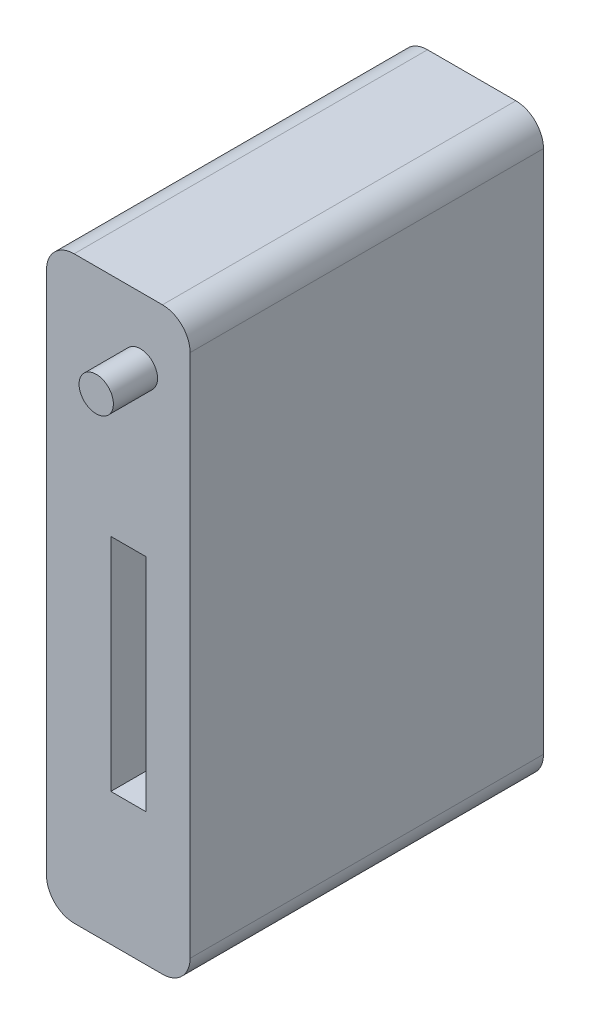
ISO-10303-21;
HEADER;
FILE_DESCRIPTION(('STEP AP214'),'2;1');
FILE_NAME('part.step','',(''),(''),'','','');
FILE_SCHEMA(('AUTOMOTIVE_DESIGN { 1 0 10303 214 1 1 1 1 }'));
ENDSEC;
DATA;
#1=APPLICATION_CONTEXT('core data for automotive mechanical design processes');
#2=APPLICATION_PROTOCOL_DEFINITION('international standard','automotive_design',2000,#1);
#3=PRODUCT_CONTEXT('',#1,'mechanical');
#4=PRODUCT('Part','Part','',(#3));
#5=PRODUCT_RELATED_PRODUCT_CATEGORY('part','',(#4));
#6=PRODUCT_DEFINITION_FORMATION('','',#4);
#7=PRODUCT_DEFINITION_CONTEXT('part definition',#1,'design');
#8=PRODUCT_DEFINITION('design','',#6,#7);
#9=PRODUCT_DEFINITION_SHAPE('','',#8);
#10=(LENGTH_UNIT() NAMED_UNIT(*) SI_UNIT(.MILLI.,.METRE.));
#11=(NAMED_UNIT(*) PLANE_ANGLE_UNIT() SI_UNIT($,.RADIAN.));
#12=(NAMED_UNIT(*) SI_UNIT($,.STERADIAN.) SOLID_ANGLE_UNIT());
#13=UNCERTAINTY_MEASURE_WITH_UNIT(LENGTH_MEASURE(1.E-05),#10,'distance_accuracy_value','');
#14=(GEOMETRIC_REPRESENTATION_CONTEXT(3) GLOBAL_UNCERTAINTY_ASSIGNED_CONTEXT((#13)) GLOBAL_UNIT_ASSIGNED_CONTEXT((#10,
#11,#12)) REPRESENTATION_CONTEXT('',''));
#15=CARTESIAN_POINT('',(0.,0.,0.));
#16=DIRECTION('',(0.,0.,1.));
#17=DIRECTION('',(1.,0.,0.));
#18=AXIS2_PLACEMENT_3D('',#15,#16,#17);
#19=CARTESIAN_POINT('',(-8.,-47.5,32.));
#20=DIRECTION('',(0.,0.,-1.));
#21=DIRECTION('',(-1.,0.,0.));
#22=AXIS2_PLACEMENT_3D('',#19,#20,#21);
#23=PLANE('',#22);
#24=CARTESIAN_POINT('',(-8.,-47.5,32.));
#25=DIRECTION('',(0.,0.,1.));
#26=DIRECTION('',(-1.,0.,0.));
#27=AXIS2_PLACEMENT_3D('',#24,#25,#26);
#28=CIRCLE('',#27,5.);
#29=CARTESIAN_POINT('',(-13.,-47.5,32.));
#30=VERTEX_POINT('',#29);
#31=CARTESIAN_POINT('',(-8.,-52.5,32.));
#32=VERTEX_POINT('',#31);
#33=EDGE_CURVE('E160',#30,#32,#28,.T.);
#34=ORIENTED_EDGE('',*,*,#33,.T.);
#35=DIRECTION('',(1.,0.,0.));
#36=VECTOR('',#35,1.);
#37=CARTESIAN_POINT('',(-8.,-52.5,32.));
#38=LINE('',#37,#36);
#39=CARTESIAN_POINT('',(7.99999999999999,-52.5,32.));
#40=VERTEX_POINT('',#39);
#41=EDGE_CURVE('E100',#32,#40,#38,.T.);
#42=ORIENTED_EDGE('',*,*,#41,.T.);
#43=CARTESIAN_POINT('',(7.99999999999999,-47.5,32.));
#44=DIRECTION('',(0.,0.,1.));
#45=DIRECTION('',(1.,0.,0.));
#46=AXIS2_PLACEMENT_3D('',#43,#44,#45);
#47=CIRCLE('',#46,5.);
#48=CARTESIAN_POINT('',(13.,-47.5,32.));
#49=VERTEX_POINT('',#48);
#50=EDGE_CURVE('E191',#40,#49,#47,.T.);
#51=ORIENTED_EDGE('',*,*,#50,.T.);
#52=DIRECTION('',(0.,1.,0.));
#53=VECTOR('',#52,1.);
#54=CARTESIAN_POINT('',(13.,-47.5,32.));
#55=LINE('',#54,#53);
#56=CARTESIAN_POINT('',(13.,47.5,32.));
#57=VERTEX_POINT('',#56);
#58=EDGE_CURVE('E190',#49,#57,#55,.T.);
#59=ORIENTED_EDGE('',*,*,#58,.T.);
#60=CARTESIAN_POINT('',(7.99999999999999,47.5,32.));
#61=DIRECTION('',(0.,0.,1.));
#62=DIRECTION('',(-1.,0.,0.));
#63=AXIS2_PLACEMENT_3D('',#60,#61,#62);
#64=CIRCLE('',#63,5.);
#65=CARTESIAN_POINT('',(7.99999999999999,52.5,32.));
#66=VERTEX_POINT('',#65);
#67=EDGE_CURVE('E123',#57,#66,#64,.T.);
#68=ORIENTED_EDGE('',*,*,#67,.T.);
#69=DIRECTION('',(-1.,0.,0.));
#70=VECTOR('',#69,1.);
#71=CARTESIAN_POINT('',(-8.,52.5,32.));
#72=LINE('',#71,#70);
#73=CARTESIAN_POINT('',(-8.,52.5,32.));
#74=VERTEX_POINT('',#73);
#75=EDGE_CURVE('E116',#66,#74,#72,.T.);
#76=ORIENTED_EDGE('',*,*,#75,.T.);
#77=CARTESIAN_POINT('',(-8.,47.5,32.));
#78=DIRECTION('',(0.,0.,1.));
#79=DIRECTION('',(-1.,0.,0.));
#80=AXIS2_PLACEMENT_3D('',#77,#78,#79);
#81=CIRCLE('',#80,5.);
#82=CARTESIAN_POINT('',(-13.,47.5,32.));
#83=VERTEX_POINT('',#82);
#84=EDGE_CURVE('E120',#74,#83,#81,.T.);
#85=ORIENTED_EDGE('',*,*,#84,.T.);
#86=DIRECTION('',(0.,-1.,0.));
#87=VECTOR('',#86,1.);
#88=CARTESIAN_POINT('',(-13.,-47.5,32.));
#89=LINE('',#88,#87);
#90=EDGE_CURVE('E58',#83,#30,#89,.T.);
#91=ORIENTED_EDGE('',*,*,#90,.T.);
#92=EDGE_LOOP('',(#34,#42,#51,#59,#68,#76,#85,#91));
#93=FACE_BOUND('',#92,.T.);
#94=DIRECTION('',(1.,0.,0.));
#95=VECTOR('',#94,1.);
#96=CARTESIAN_POINT('',(-1.35000000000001,-28.5,32.));
#97=LINE('',#96,#95);
#98=CARTESIAN_POINT('',(-1.35000000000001,-28.5,32.));
#99=VERTEX_POINT('',#98);
#100=CARTESIAN_POINT('',(4.99999999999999,-28.5,32.));
#101=VERTEX_POINT('',#100);
#102=EDGE_CURVE('E214',#99,#101,#97,.T.);
#103=ORIENTED_EDGE('',*,*,#102,.F.);
#104=DIRECTION('',(0.,-1.,0.));
#105=VECTOR('',#104,1.);
#106=CARTESIAN_POINT('',(-1.35000000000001,-28.5,32.));
#107=LINE('',#106,#105);
#108=CARTESIAN_POINT('',(-1.35000000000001,11.5,32.));
#109=VERTEX_POINT('',#108);
#110=EDGE_CURVE('E49',#109,#99,#107,.T.);
#111=ORIENTED_EDGE('',*,*,#110,.F.);
#112=DIRECTION('',(-1.,0.,0.));
#113=VECTOR('',#112,1.);
#114=CARTESIAN_POINT('',(-1.35000000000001,11.5,32.));
#115=LINE('',#114,#113);
#116=CARTESIAN_POINT('',(4.99999999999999,11.5,32.));
#117=VERTEX_POINT('',#116);
#118=EDGE_CURVE('E207',#117,#109,#115,.T.);
#119=ORIENTED_EDGE('',*,*,#118,.F.);
#120=DIRECTION('',(0.,1.,0.));
#121=VECTOR('',#120,1.);
#122=CARTESIAN_POINT('',(4.99999999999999,-28.5,32.));
#123=LINE('',#122,#121);
#124=EDGE_CURVE('E211',#101,#117,#123,.T.);
#125=ORIENTED_EDGE('',*,*,#124,.F.);
#126=EDGE_LOOP('',(#103,#111,#119,#125));
#127=FACE_BOUND('',#126,.T.);
#128=CARTESIAN_POINT('',(3.99999999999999,40.5,32.));
#129=DIRECTION('',(0.,0.,-1.));
#130=DIRECTION('',(-1.,0.,0.));
#131=AXIS2_PLACEMENT_3D('',#128,#129,#130);
#132=CIRCLE('',#131,3.105);
#133=CARTESIAN_POINT('',(0.894999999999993,40.5,32.));
#134=VERTEX_POINT('',#133);
#135=EDGE_CURVE('E11',#134,#134,#132,.F.);
#136=ORIENTED_EDGE('',*,*,#135,.F.);
#137=EDGE_LOOP('',(#136));
#138=FACE_BOUND('',#137,.T.);
#139=ADVANCED_FACE('F34',(#93,#127,#138),#23,.F.);
#140=CARTESIAN_POINT('',(-8.,-47.5,32.));
#141=DIRECTION('',(0.,0.,-1.));
#142=DIRECTION('',(-1.,0.,0.));
#143=AXIS2_PLACEMENT_3D('',#140,#141,#142);
#144=CYLINDRICAL_SURFACE('',#143,5.);
#145=CARTESIAN_POINT('',(-8.,-47.5,-32.));
#146=DIRECTION('',(0.,0.,1.));
#147=DIRECTION('',(-1.,0.,0.));
#148=AXIS2_PLACEMENT_3D('',#145,#146,#147);
#149=CIRCLE('',#148,5.);
#150=CARTESIAN_POINT('',(-13.,-47.5,-32.));
#151=VERTEX_POINT('',#150);
#152=CARTESIAN_POINT('',(-8.,-52.5,-32.));
#153=VERTEX_POINT('',#152);
#154=EDGE_CURVE('E144',#151,#153,#149,.T.);
#155=ORIENTED_EDGE('',*,*,#154,.T.);
#156=DIRECTION('',(0.,0.,-1.));
#157=VECTOR('',#156,1.);
#158=CARTESIAN_POINT('',(-8.,-52.5,32.));
#159=LINE('',#158,#157);
#160=EDGE_CURVE('E42',#32,#153,#159,.T.);
#161=ORIENTED_EDGE('',*,*,#160,.F.);
#162=ORIENTED_EDGE('',*,*,#33,.F.);
#163=DIRECTION('',(0.,0.,-1.));
#164=VECTOR('',#163,1.);
#165=CARTESIAN_POINT('',(-13.,-47.5,32.));
#166=LINE('',#165,#164);
#167=EDGE_CURVE('E140',#30,#151,#166,.T.);
#168=ORIENTED_EDGE('',*,*,#167,.T.);
#169=EDGE_LOOP('',(#155,#161,#162,#168));
#170=FACE_BOUND('',#169,.T.);
#171=ADVANCED_FACE('F36',(#170),#144,.T.);
#172=CARTESIAN_POINT('',(-8.,-52.5,32.));
#173=DIRECTION('',(0.,1.,0.));
#174=DIRECTION('',(0.,0.,1.));
#175=AXIS2_PLACEMENT_3D('',#172,#173,#174);
#176=PLANE('',#175);
#177=DIRECTION('',(1.,0.,0.));
#178=VECTOR('',#177,1.);
#179=CARTESIAN_POINT('',(-8.,-52.5,-32.));
#180=LINE('',#179,#178);
#181=CARTESIAN_POINT('',(7.99999999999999,-52.5,-32.));
#182=VERTEX_POINT('',#181);
#183=EDGE_CURVE('E147',#153,#182,#180,.T.);
#184=ORIENTED_EDGE('',*,*,#183,.T.);
#185=DIRECTION('',(0.,0.,-1.));
#186=VECTOR('',#185,1.);
#187=CARTESIAN_POINT('',(7.99999999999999,-52.5,32.));
#188=LINE('',#187,#186);
#189=EDGE_CURVE('E170',#40,#182,#188,.T.);
#190=ORIENTED_EDGE('',*,*,#189,.F.);
#191=ORIENTED_EDGE('',*,*,#41,.F.);
#192=ORIENTED_EDGE('',*,*,#160,.T.);
#193=EDGE_LOOP('',(#184,#190,#191,#192));
#194=FACE_BOUND('',#193,.T.);
#195=ADVANCED_FACE('F173',(#194),#176,.F.);
#196=CARTESIAN_POINT('',(7.99999999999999,-47.5,32.));
#197=DIRECTION('',(0.,0.,-1.));
#198=DIRECTION('',(-1.,0.,0.));
#199=AXIS2_PLACEMENT_3D('',#196,#197,#198);
#200=CYLINDRICAL_SURFACE('',#199,5.);
#201=CARTESIAN_POINT('',(7.99999999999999,-47.5,-32.));
#202=DIRECTION('',(0.,0.,1.));
#203=DIRECTION('',(1.,0.,0.));
#204=AXIS2_PLACEMENT_3D('',#201,#202,#203);
#205=CIRCLE('',#204,5.);
#206=CARTESIAN_POINT('',(13.,-47.5,-32.));
#207=VERTEX_POINT('',#206);
#208=EDGE_CURVE('E150',#182,#207,#205,.T.);
#209=ORIENTED_EDGE('',*,*,#208,.T.);
#210=DIRECTION('',(0.,0.,-1.));
#211=VECTOR('',#210,1.);
#212=CARTESIAN_POINT('',(13.,-47.5,32.));
#213=LINE('',#212,#211);
#214=EDGE_CURVE('E167',#49,#207,#213,.T.);
#215=ORIENTED_EDGE('',*,*,#214,.F.);
#216=ORIENTED_EDGE('',*,*,#50,.F.);
#217=ORIENTED_EDGE('',*,*,#189,.T.);
#218=EDGE_LOOP('',(#209,#215,#216,#217));
#219=FACE_BOUND('',#218,.T.);
#220=ADVANCED_FACE('F184',(#219),#200,.T.);
#221=CARTESIAN_POINT('',(13.,-47.5,32.));
#222=DIRECTION('',(-1.,0.,0.));
#223=DIRECTION('',(0.,0.,1.));
#224=AXIS2_PLACEMENT_3D('',#221,#222,#223);
#225=PLANE('',#224);
#226=DIRECTION('',(0.,1.,0.));
#227=VECTOR('',#226,1.);
#228=CARTESIAN_POINT('',(13.,-47.5,-32.));
#229=LINE('',#228,#227);
#230=CARTESIAN_POINT('',(13.,47.5,-32.));
#231=VERTEX_POINT('',#230);
#232=EDGE_CURVE('E152',#207,#231,#229,.T.);
#233=ORIENTED_EDGE('',*,*,#232,.T.);
#234=DIRECTION('',(0.,0.,-1.));
#235=VECTOR('',#234,1.);
#236=CARTESIAN_POINT('',(13.,47.5,32.));
#237=LINE('',#236,#235);
#238=EDGE_CURVE('E164',#57,#231,#237,.T.);
#239=ORIENTED_EDGE('',*,*,#238,.F.);
#240=ORIENTED_EDGE('',*,*,#58,.F.);
#241=ORIENTED_EDGE('',*,*,#214,.T.);
#242=EDGE_LOOP('',(#233,#239,#240,#241));
#243=FACE_BOUND('',#242,.T.);
#244=ADVANCED_FACE('F188',(#243),#225,.F.);
#245=CARTESIAN_POINT('',(7.99999999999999,47.5,32.));
#246=DIRECTION('',(0.,0.,-1.));
#247=DIRECTION('',(-1.,0.,0.));
#248=AXIS2_PLACEMENT_3D('',#245,#246,#247);
#249=CYLINDRICAL_SURFACE('',#248,5.);
#250=CARTESIAN_POINT('',(7.99999999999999,47.5,-32.));
#251=DIRECTION('',(0.,0.,1.));
#252=DIRECTION('',(-1.,0.,0.));
#253=AXIS2_PLACEMENT_3D('',#250,#251,#252);
#254=CIRCLE('',#253,5.);
#255=CARTESIAN_POINT('',(7.99999999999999,52.5,-32.));
#256=VERTEX_POINT('',#255);
#257=EDGE_CURVE('E154',#231,#256,#254,.T.);
#258=ORIENTED_EDGE('',*,*,#257,.T.);
#259=DIRECTION('',(0.,0.,-1.));
#260=VECTOR('',#259,1.);
#261=CARTESIAN_POINT('',(7.99999999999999,52.5,32.));
#262=LINE('',#261,#260);
#263=EDGE_CURVE('E135',#66,#256,#262,.T.);
#264=ORIENTED_EDGE('',*,*,#263,.F.);
#265=ORIENTED_EDGE('',*,*,#67,.F.);
#266=ORIENTED_EDGE('',*,*,#238,.T.);
#267=EDGE_LOOP('',(#258,#264,#265,#266));
#268=FACE_BOUND('',#267,.T.);
#269=ADVANCED_FACE('F259',(#268),#249,.T.);
#270=CARTESIAN_POINT('',(-8.,52.5,32.));
#271=DIRECTION('',(0.,-1.,0.));
#272=DIRECTION('',(0.,0.,-1.));
#273=AXIS2_PLACEMENT_3D('',#270,#271,#272);
#274=PLANE('',#273);
#275=DIRECTION('',(-1.,0.,0.));
#276=VECTOR('',#275,1.);
#277=CARTESIAN_POINT('',(-8.,52.5,-32.));
#278=LINE('',#277,#276);
#279=CARTESIAN_POINT('',(-8.,52.5,-32.));
#280=VERTEX_POINT('',#279);
#281=EDGE_CURVE('E132',#256,#280,#278,.T.);
#282=ORIENTED_EDGE('',*,*,#281,.T.);
#283=DIRECTION('',(0.,0.,-1.));
#284=VECTOR('',#283,1.);
#285=CARTESIAN_POINT('',(-8.,52.5,32.));
#286=LINE('',#285,#284);
#287=EDGE_CURVE('E129',#74,#280,#286,.T.);
#288=ORIENTED_EDGE('',*,*,#287,.F.);
#289=ORIENTED_EDGE('',*,*,#75,.F.);
#290=ORIENTED_EDGE('',*,*,#263,.T.);
#291=EDGE_LOOP('',(#282,#288,#289,#290));
#292=FACE_BOUND('',#291,.T.);
#293=ADVANCED_FACE('F130',(#292),#274,.F.);
#294=CARTESIAN_POINT('',(-8.,47.5,32.));
#295=DIRECTION('',(0.,0.,-1.));
#296=DIRECTION('',(-1.,0.,0.));
#297=AXIS2_PLACEMENT_3D('',#294,#295,#296);
#298=CYLINDRICAL_SURFACE('',#297,5.);
#299=CARTESIAN_POINT('',(-8.,47.5,-32.));
#300=DIRECTION('',(0.,0.,1.));
#301=DIRECTION('',(-1.,0.,0.));
#302=AXIS2_PLACEMENT_3D('',#299,#300,#301);
#303=CIRCLE('',#302,5.);
#304=CARTESIAN_POINT('',(-13.,47.5,-32.));
#305=VERTEX_POINT('',#304);
#306=EDGE_CURVE('E157',#280,#305,#303,.T.);
#307=ORIENTED_EDGE('',*,*,#306,.T.);
#308=DIRECTION('',(0.,0.,-1.));
#309=VECTOR('',#308,1.);
#310=CARTESIAN_POINT('',(-13.,47.5,32.));
#311=LINE('',#310,#309);
#312=EDGE_CURVE('E136',#83,#305,#311,.T.);
#313=ORIENTED_EDGE('',*,*,#312,.F.);
#314=ORIENTED_EDGE('',*,*,#84,.F.);
#315=ORIENTED_EDGE('',*,*,#287,.T.);
#316=EDGE_LOOP('',(#307,#313,#314,#315));
#317=FACE_BOUND('',#316,.T.);
#318=ADVANCED_FACE('F138',(#317),#298,.T.);
#319=CARTESIAN_POINT('',(-13.,-47.5,32.));
#320=DIRECTION('',(1.,0.,0.));
#321=DIRECTION('',(0.,0.,-1.));
#322=AXIS2_PLACEMENT_3D('',#319,#320,#321);
#323=PLANE('',#322);
#324=DIRECTION('',(0.,-1.,0.));
#325=VECTOR('',#324,1.);
#326=CARTESIAN_POINT('',(-13.,-47.5,-32.));
#327=LINE('',#326,#325);
#328=EDGE_CURVE('E91',#305,#151,#327,.T.);
#329=ORIENTED_EDGE('',*,*,#328,.T.);
#330=ORIENTED_EDGE('',*,*,#167,.F.);
#331=ORIENTED_EDGE('',*,*,#90,.F.);
#332=ORIENTED_EDGE('',*,*,#312,.T.);
#333=EDGE_LOOP('',(#329,#330,#331,#332));
#334=FACE_BOUND('',#333,.T.);
#335=ADVANCED_FACE('F252',(#334),#323,.F.);
#336=CARTESIAN_POINT('',(-8.,-47.5,-32.));
#337=DIRECTION('',(0.,0.,-1.));
#338=DIRECTION('',(-1.,0.,0.));
#339=AXIS2_PLACEMENT_3D('',#336,#337,#338);
#340=PLANE('',#339);
#341=ORIENTED_EDGE('',*,*,#154,.F.);
#342=ORIENTED_EDGE('',*,*,#328,.F.);
#343=ORIENTED_EDGE('',*,*,#306,.F.);
#344=ORIENTED_EDGE('',*,*,#281,.F.);
#345=ORIENTED_EDGE('',*,*,#257,.F.);
#346=ORIENTED_EDGE('',*,*,#232,.F.);
#347=ORIENTED_EDGE('',*,*,#208,.F.);
#348=ORIENTED_EDGE('',*,*,#183,.F.);
#349=EDGE_LOOP('',(#341,#342,#343,#344,#345,#346,#347,#348));
#350=FACE_BOUND('',#349,.T.);
#351=ADVANCED_FACE('F178',(#350),#340,.T.);
#352=CARTESIAN_POINT('',(-1.35000000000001,-28.5,24.38));
#353=DIRECTION('',(-1.,0.,0.));
#354=DIRECTION('',(0.,0.,1.));
#355=AXIS2_PLACEMENT_3D('',#352,#353,#354);
#356=PLANE('',#355);
#357=ORIENTED_EDGE('',*,*,#110,.T.);
#358=DIRECTION('',(0.,0.,1.));
#359=VECTOR('',#358,1.);
#360=CARTESIAN_POINT('',(-1.35000000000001,-28.5,24.38));
#361=LINE('',#360,#359);
#362=CARTESIAN_POINT('',(-1.35000000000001,-28.5,24.38));
#363=VERTEX_POINT('',#362);
#364=EDGE_CURVE('E197',#363,#99,#361,.T.);
#365=ORIENTED_EDGE('',*,*,#364,.F.);
#366=DIRECTION('',(0.,-1.,0.));
#367=VECTOR('',#366,1.);
#368=CARTESIAN_POINT('',(-1.35000000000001,-28.5,24.38));
#369=LINE('',#368,#367);
#370=CARTESIAN_POINT('',(-1.35000000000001,11.5,24.38));
#371=VERTEX_POINT('',#370);
#372=EDGE_CURVE('E210',#371,#363,#369,.T.);
#373=ORIENTED_EDGE('',*,*,#372,.F.);
#374=DIRECTION('',(0.,0.,1.));
#375=VECTOR('',#374,1.);
#376=CARTESIAN_POINT('',(-1.35000000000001,11.5,24.38));
#377=LINE('',#376,#375);
#378=EDGE_CURVE('E148',#371,#109,#377,.T.);
#379=ORIENTED_EDGE('',*,*,#378,.T.);
#380=EDGE_LOOP('',(#357,#365,#373,#379));
#381=FACE_BOUND('',#380,.T.);
#382=ADVANCED_FACE('F248',(#381),#356,.F.);
#383=CARTESIAN_POINT('',(-1.35000000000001,11.5,24.38));
#384=DIRECTION('',(0.,1.,0.));
#385=DIRECTION('',(0.,0.,1.));
#386=AXIS2_PLACEMENT_3D('',#383,#384,#385);
#387=PLANE('',#386);
#388=ORIENTED_EDGE('',*,*,#118,.T.);
#389=ORIENTED_EDGE('',*,*,#378,.F.);
#390=DIRECTION('',(-1.,0.,0.));
#391=VECTOR('',#390,1.);
#392=CARTESIAN_POINT('',(-1.35000000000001,11.5,24.38));
#393=LINE('',#392,#391);
#394=CARTESIAN_POINT('',(4.99999999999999,11.5,24.38));
#395=VERTEX_POINT('',#394);
#396=EDGE_CURVE('E200',#395,#371,#393,.T.);
#397=ORIENTED_EDGE('',*,*,#396,.F.);
#398=DIRECTION('',(0.,0.,1.));
#399=VECTOR('',#398,1.);
#400=CARTESIAN_POINT('',(4.99999999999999,11.5,24.38));
#401=LINE('',#400,#399);
#402=EDGE_CURVE('E203',#395,#117,#401,.T.);
#403=ORIENTED_EDGE('',*,*,#402,.T.);
#404=EDGE_LOOP('',(#388,#389,#397,#403));
#405=FACE_BOUND('',#404,.T.);
#406=ADVANCED_FACE('F305',(#405),#387,.F.);
#407=CARTESIAN_POINT('',(4.99999999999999,-28.5,24.38));
#408=DIRECTION('',(1.,0.,0.));
#409=DIRECTION('',(0.,0.,-1.));
#410=AXIS2_PLACEMENT_3D('',#407,#408,#409);
#411=PLANE('',#410);
#412=ORIENTED_EDGE('',*,*,#124,.T.);
#413=ORIENTED_EDGE('',*,*,#402,.F.);
#414=DIRECTION('',(0.,1.,0.));
#415=VECTOR('',#414,1.);
#416=CARTESIAN_POINT('',(4.99999999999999,-28.5,24.38));
#417=LINE('',#416,#415);
#418=CARTESIAN_POINT('',(4.99999999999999,-28.5,24.38));
#419=VERTEX_POINT('',#418);
#420=EDGE_CURVE('E221',#419,#395,#417,.T.);
#421=ORIENTED_EDGE('',*,*,#420,.F.);
#422=DIRECTION('',(0.,0.,1.));
#423=VECTOR('',#422,1.);
#424=CARTESIAN_POINT('',(4.99999999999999,-28.5,24.38));
#425=LINE('',#424,#423);
#426=EDGE_CURVE('E199',#419,#101,#425,.T.);
#427=ORIENTED_EDGE('',*,*,#426,.T.);
#428=EDGE_LOOP('',(#412,#413,#421,#427));
#429=FACE_BOUND('',#428,.T.);
#430=ADVANCED_FACE('F311',(#429),#411,.F.);
#431=CARTESIAN_POINT('',(-1.35000000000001,-28.5,24.38));
#432=DIRECTION('',(0.,-1.,0.));
#433=DIRECTION('',(0.,0.,-1.));
#434=AXIS2_PLACEMENT_3D('',#431,#432,#433);
#435=PLANE('',#434);
#436=ORIENTED_EDGE('',*,*,#102,.T.);
#437=ORIENTED_EDGE('',*,*,#426,.F.);
#438=DIRECTION('',(1.,0.,0.));
#439=VECTOR('',#438,1.);
#440=CARTESIAN_POINT('',(-1.35000000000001,-28.5,24.38));
#441=LINE('',#440,#439);
#442=EDGE_CURVE('E224',#363,#419,#441,.T.);
#443=ORIENTED_EDGE('',*,*,#442,.F.);
#444=ORIENTED_EDGE('',*,*,#364,.T.);
#445=EDGE_LOOP('',(#436,#437,#443,#444));
#446=FACE_BOUND('',#445,.T.);
#447=ADVANCED_FACE('F319',(#446),#435,.F.);
#448=CARTESIAN_POINT('',(0.,0.,24.38));
#449=DIRECTION('',(0.,0.,-1.));
#450=DIRECTION('',(-1.,0.,0.));
#451=AXIS2_PLACEMENT_3D('',#448,#449,#450);
#452=PLANE('',#451);
#453=ORIENTED_EDGE('',*,*,#372,.T.);
#454=ORIENTED_EDGE('',*,*,#442,.T.);
#455=ORIENTED_EDGE('',*,*,#420,.T.);
#456=ORIENTED_EDGE('',*,*,#396,.T.);
#457=EDGE_LOOP('',(#453,#454,#455,#456));
#458=FACE_BOUND('',#457,.T.);
#459=ADVANCED_FACE('F237',(#458),#452,.F.);
#460=CARTESIAN_POINT('',(3.99999999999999,40.5,40.));
#461=DIRECTION('',(0.,0.,-1.));
#462=DIRECTION('',(-1.,0.,0.));
#463=AXIS2_PLACEMENT_3D('',#460,#461,#462);
#464=CYLINDRICAL_SURFACE('',#463,3.105);
#465=CARTESIAN_POINT('',(3.99999999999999,40.5,40.));
#466=DIRECTION('',(0.,0.,1.));
#467=DIRECTION('',(1.,0.,0.));
#468=AXIS2_PLACEMENT_3D('',#465,#466,#467);
#469=CIRCLE('',#468,3.105);
#470=CARTESIAN_POINT('',(7.10499999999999,40.5,40.));
#471=VERTEX_POINT('',#470);
#472=EDGE_CURVE('E218',#471,#471,#469,.T.);
#473=ORIENTED_EDGE('',*,*,#472,.F.);
#474=EDGE_LOOP('',(#473));
#475=FACE_BOUND('',#474,.T.);
#476=ORIENTED_EDGE('',*,*,#135,.T.);
#477=EDGE_LOOP('',(#476));
#478=FACE_BOUND('',#477,.T.);
#479=ADVANCED_FACE('F234',(#475,#478),#464,.T.);
#480=CARTESIAN_POINT('',(3.99999999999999,40.5,40.));
#481=DIRECTION('',(0.,0.,1.));
#482=DIRECTION('',(1.,0.,0.));
#483=AXIS2_PLACEMENT_3D('',#480,#481,#482);
#484=PLANE('',#483);
#485=ORIENTED_EDGE('',*,*,#472,.T.);
#486=EDGE_LOOP('',(#485));
#487=FACE_BOUND('',#486,.T.);
#488=ADVANCED_FACE('F232',(#487),#484,.T.);
#489=CLOSED_SHELL('',(#139,#171,#195,#220,#244,#269,#293,#318,#335,#351,#382,#406,#430,#447,
#459,#479,#488));
#490=MANIFOLD_SOLID_BREP('B2',#489);
#491=ADVANCED_BREP_SHAPE_REPRESENTATION('',(#18,#490),#14);
#492=SHAPE_DEFINITION_REPRESENTATION(#9,#491);
ENDSEC;
END-ISO-10303-21;
